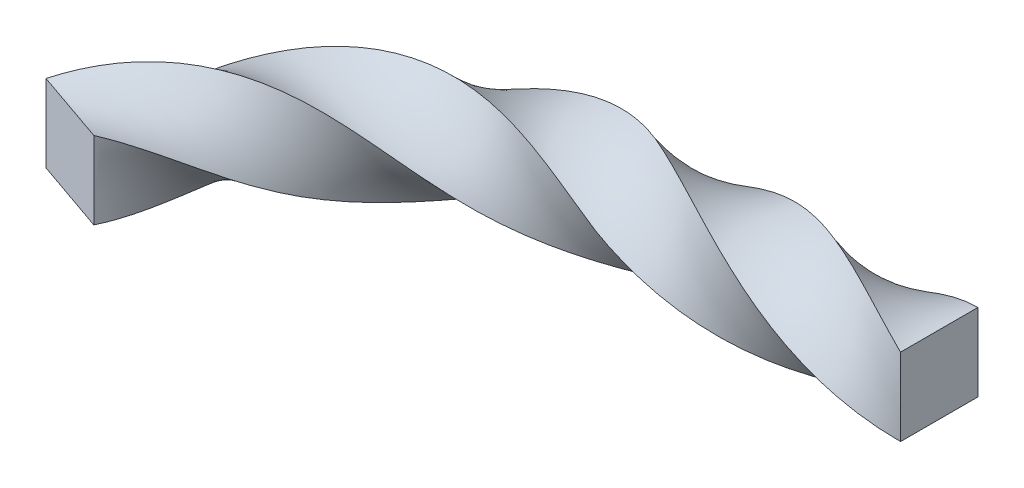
ISO-10303-21;
HEADER;
FILE_DESCRIPTION(('STEP AP214'),'2;1');
FILE_NAME('part.step','',(''),(''),'','','');
FILE_SCHEMA(('AUTOMOTIVE_DESIGN { 1 0 10303 214 1 1 1 1 }'));
ENDSEC;
DATA;
#1=APPLICATION_CONTEXT('core data for automotive mechanical design processes');
#2=APPLICATION_PROTOCOL_DEFINITION('international standard','automotive_design',2000,#1);
#3=PRODUCT_CONTEXT('',#1,'mechanical');
#4=PRODUCT('Part','Part','',(#3));
#5=PRODUCT_RELATED_PRODUCT_CATEGORY('part','',(#4));
#6=PRODUCT_DEFINITION_FORMATION('','',#4);
#7=PRODUCT_DEFINITION_CONTEXT('part definition',#1,'design');
#8=PRODUCT_DEFINITION('design','',#6,#7);
#9=PRODUCT_DEFINITION_SHAPE('','',#8);
#10=(LENGTH_UNIT() NAMED_UNIT(*) SI_UNIT(.MILLI.,.METRE.));
#11=(NAMED_UNIT(*) PLANE_ANGLE_UNIT() SI_UNIT($,.RADIAN.));
#12=(NAMED_UNIT(*) SI_UNIT($,.STERADIAN.) SOLID_ANGLE_UNIT());
#13=UNCERTAINTY_MEASURE_WITH_UNIT(LENGTH_MEASURE(1.E-05),#10,'distance_accuracy_value','');
#14=(GEOMETRIC_REPRESENTATION_CONTEXT(3) GLOBAL_UNCERTAINTY_ASSIGNED_CONTEXT((#13)) GLOBAL_UNIT_ASSIGNED_CONTEXT((#10,
#11,#12)) REPRESENTATION_CONTEXT('',''));
#15=CARTESIAN_POINT('',(0.,0.,0.));
#16=DIRECTION('',(0.,0.,1.));
#17=DIRECTION('',(1.,0.,0.));
#18=AXIS2_PLACEMENT_3D('',#15,#16,#17);
#19=CARTESIAN_POINT('',(0.,0.,0.));
#20=DIRECTION('',(1.,0.,0.));
#21=DIRECTION('',(0.,0.,-1.));
#22=AXIS2_PLACEMENT_3D('',#19,#20,#21);
#23=PLANE('',#22);
#24=DIRECTION('',(0.,1.,0.));
#25=VECTOR('',#24,1.);
#26=CARTESIAN_POINT('',(0.,-21.,-21.));
#27=LINE('',#26,#25);
#28=CARTESIAN_POINT('',(0.,-21.,-21.));
#29=VERTEX_POINT('',#28);
#30=CARTESIAN_POINT('',(0.,21.,-21.));
#31=VERTEX_POINT('',#30);
#32=EDGE_CURVE('E95',#29,#31,#27,.T.);
#33=ORIENTED_EDGE('',*,*,#32,.T.);
#34=DIRECTION('',(0.,0.,1.));
#35=VECTOR('',#34,1.);
#36=CARTESIAN_POINT('',(0.,21.,-21.));
#37=LINE('',#36,#35);
#38=CARTESIAN_POINT('',(0.,21.,21.));
#39=VERTEX_POINT('',#38);
#40=EDGE_CURVE('E88',#31,#39,#37,.T.);
#41=ORIENTED_EDGE('',*,*,#40,.T.);
#42=DIRECTION('',(0.,-1.,0.));
#43=VECTOR('',#42,1.);
#44=CARTESIAN_POINT('',(0.,-21.,21.));
#45=LINE('',#44,#43);
#46=CARTESIAN_POINT('',(0.,-21.,21.));
#47=VERTEX_POINT('',#46);
#48=EDGE_CURVE('E83',#39,#47,#45,.T.);
#49=ORIENTED_EDGE('',*,*,#48,.T.);
#50=DIRECTION('',(0.,0.,-1.));
#51=VECTOR('',#50,1.);
#52=CARTESIAN_POINT('',(0.,-21.,-21.));
#53=LINE('',#52,#51);
#54=EDGE_CURVE('E78',#47,#29,#53,.T.);
#55=ORIENTED_EDGE('',*,*,#54,.T.);
#56=EDGE_LOOP('',(#33,#41,#49,#55));
#57=FACE_BOUND('',#56,.T.);
#58=ADVANCED_FACE('F43',(#57),#23,.T.);
#59=CARTESIAN_POINT('',(-340.19826274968,0.,131.));
#60=DIRECTION('',(0.328205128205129,0.,-0.944606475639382));
#61=DIRECTION('',(-0.944606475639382,0.,-0.328205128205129));
#62=AXIS2_PLACEMENT_3D('',#59,#60,#61);
#63=PLANE('',#62);
#64=DIRECTION('',(0.,1.,0.));
#65=VECTOR('',#64,1.);
#66=CARTESIAN_POINT('',(-360.034998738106,-21.0000000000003,124.107692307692));
#67=LINE('',#66,#65);
#68=CARTESIAN_POINT('',(-360.034998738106,-21.0000000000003,124.107692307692));
#69=VERTEX_POINT('',#68);
#70=CARTESIAN_POINT('',(-360.034998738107,20.9999999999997,124.107692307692));
#71=VERTEX_POINT('',#70);
#72=EDGE_CURVE('E123',#69,#71,#67,.T.);
#73=ORIENTED_EDGE('',*,*,#72,.F.);
#74=DIRECTION('',(-0.944606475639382,0.,-0.328205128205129));
#75=VECTOR('',#74,1.);
#76=CARTESIAN_POINT('',(-360.034998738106,-21.0000000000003,124.107692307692));
#77=LINE('',#76,#75);
#78=CARTESIAN_POINT('',(-320.361526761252,-20.9999999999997,137.892307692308));
#79=VERTEX_POINT('',#78);
#80=EDGE_CURVE('E11',#79,#69,#77,.T.);
#81=ORIENTED_EDGE('',*,*,#80,.F.);
#82=DIRECTION('',(0.,-1.,0.));
#83=VECTOR('',#82,1.);
#84=CARTESIAN_POINT('',(-320.361526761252,-20.9999999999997,137.892307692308));
#85=LINE('',#84,#83);
#86=CARTESIAN_POINT('',(-320.361526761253,21.0000000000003,137.892307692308));
#87=VERTEX_POINT('',#86);
#88=EDGE_CURVE('E51',#87,#79,#85,.T.);
#89=ORIENTED_EDGE('',*,*,#88,.F.);
#90=DIRECTION('',(0.944606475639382,0.,0.328205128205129));
#91=VECTOR('',#90,1.);
#92=CARTESIAN_POINT('',(-360.034998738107,20.9999999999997,124.107692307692));
#93=LINE('',#92,#91);
#94=EDGE_CURVE('E66',#71,#87,#93,.T.);
#95=ORIENTED_EDGE('',*,*,#94,.F.);
#96=EDGE_LOOP('',(#73,#81,#89,#95));
#97=FACE_BOUND('',#96,.T.);
#98=ADVANCED_FACE('F144',(#97),#63,.F.);
#99=CARTESIAN_POINT('',(0.,-21.,-21.));
#100=CARTESIAN_POINT('',(-6.50008105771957,-23.1598402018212,-18.8401597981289));
#101=CARTESIAN_POINT('',(-12.9999999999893,-24.9834839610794,-16.3448804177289));
#102=CARTESIAN_POINT('',(-26.0000000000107,-27.7873711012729,-10.9174902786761));
#103=CARTESIAN_POINT('',(-32.4999999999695,-28.7671659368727,-7.9862225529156));
#104=CARTESIAN_POINT('',(-45.5000000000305,-29.7904949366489,-1.96366955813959));
#105=CARTESIAN_POINT('',(-51.9999999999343,-29.8338752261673,1.12671011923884));
#106=CARTESIAN_POINT('',(-65.0000000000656,-28.9799957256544,7.17561387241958));
#107=CARTESIAN_POINT('',(-71.500000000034,-28.0828643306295,10.133228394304));
#108=CARTESIAN_POINT('',(-84.499999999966,-25.4324226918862,15.6371820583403));
#109=CARTESIAN_POINT('',(-91.000000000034,-23.6795109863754,18.1826935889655));
#110=CARTESIAN_POINT('',(-103.999999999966,-19.4828334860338,22.621865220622));
#111=CARTESIAN_POINT('',(-110.500000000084,-17.0396987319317,24.5148578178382));
#112=CARTESIAN_POINT('',(-123.499999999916,-11.6931489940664,27.4699809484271));
#113=CARTESIAN_POINT('',(-130.000000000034,-8.79053795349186,28.5316671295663));
#114=CARTESIAN_POINT('',(-139.749999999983,-4.29694568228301,29.4256462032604));
#115=CARTESIAN_POINT('',(-143.000000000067,-2.77606418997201,29.6078682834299));
#116=CARTESIAN_POINT('',(-147.874999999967,-0.487266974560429,29.7043038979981));
#117=CARTESIAN_POINT('',(-149.500000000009,0.276905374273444,29.7070096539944));
#118=CARTESIAN_POINT('',(-151.937499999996,1.42161673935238,29.6668970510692));
#119=CARTESIAN_POINT('',(-152.750000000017,1.80292930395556,29.6461670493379));
#120=CARTESIAN_POINT('',(-153.968749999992,2.37408600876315,29.6040564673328));
#121=CARTESIAN_POINT('',(-154.375000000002,2.56433622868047,29.5881838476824));
#122=CARTESIAN_POINT('',(-154.984374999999,2.84945547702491,29.561625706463));
#123=CARTESIAN_POINT('',(-155.187500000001,2.94445254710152,29.5523148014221));
#124=CARTESIAN_POINT('',(-155.593749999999,3.13435249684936,29.5327774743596));
#125=CARTESIAN_POINT('',(-155.812245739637,3.2292553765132,29.5225508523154));
#126=CARTESIAN_POINT('',(-156.145086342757,3.39740276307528,29.503611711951));
#127=CARTESIAN_POINT('',(-156.266437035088,3.47066802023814,29.4952435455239));
#128=CARTESIAN_POINT('',(-156.53293661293,3.61713295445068,29.4782837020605));
#129=CARTESIAN_POINT('',(-156.66620778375,3.69033263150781,29.4696918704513));
#130=CARTESIAN_POINT('',(-157.066090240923,3.90982719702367,29.4435816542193));
#131=CARTESIAN_POINT('',(-157.332770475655,4.05601761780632,29.425728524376));
#132=CARTESIAN_POINT('',(-158.133125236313,4.4941223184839,29.3708391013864));
#133=CARTESIAN_POINT('',(-158.667113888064,4.78556999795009,29.3324723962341));
#134=CARTESIAN_POINT('',(-160.270640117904,5.65765841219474,29.2121360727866));
#135=CARTESIAN_POINT('',(-161.341739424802,6.23604371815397,29.1249242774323));
#136=CARTESIAN_POINT('',(-164.563668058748,7.95909790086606,28.8432233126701));
#137=CARTESIAN_POINT('',(-166.723161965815,9.09164639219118,28.6285768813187));
#138=CARTESIAN_POINT('',(-173.254345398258,12.4167369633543,27.9146561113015));
#139=CARTESIAN_POINT('',(-177.679591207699,14.5362492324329,27.3441176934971));
#140=CARTESIAN_POINT('',(-191.288856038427,20.4239369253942,25.4831169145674));
#141=CARTESIAN_POINT('',(-200.827318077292,23.7088599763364,24.03193348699));
#142=CARTESIAN_POINT('',(-221.070101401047,28.2759787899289,21.8220037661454));
#143=CARTESIAN_POINT('',(-231.776652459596,29.5542811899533,21.0794161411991));
#144=CARTESIAN_POINT('',(-253.891037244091,29.8192855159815,21.5851663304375));
#145=CARTESIAN_POINT('',(-265.290896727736,28.8057615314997,22.8483112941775));
#146=CARTESIAN_POINT('',(-287.675743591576,24.7095254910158,28.3300358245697));
#147=CARTESIAN_POINT('',(-298.645929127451,21.6303053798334,32.5566764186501));
#148=CARTESIAN_POINT('',(-318.745450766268,14.0867520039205,44.2247356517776));
#149=CARTESIAN_POINT('',(-327.85801087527,9.62884944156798,51.6639210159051));
#150=CARTESIAN_POINT('',(-342.988094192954,0.321042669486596,69.2014509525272));
#151=CARTESIAN_POINT('',(-348.993509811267,-4.52092685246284,79.2882952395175));
#152=CARTESIAN_POINT('',(-357.268810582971,-13.51629542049,100.945954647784));
#153=CARTESIAN_POINT('',(-359.535810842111,-17.6627626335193,112.502835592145));
#154=CARTESIAN_POINT('',(-360.034998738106,-21.0000000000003,124.107692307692));
#155=CARTESIAN_POINT('',(0.,21.,-21.));
#156=CARTESIAN_POINT('',(-6.50008105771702,18.8401597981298,-23.1598402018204));
#157=CARTESIAN_POINT('',(-12.9999999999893,16.3448804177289,-24.9834839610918));
#158=CARTESIAN_POINT('',(-26.0000000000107,10.9174902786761,-27.7873711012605));
#159=CARTESIAN_POINT('',(-32.4999999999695,7.98622255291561,-28.7671659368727));
#160=CARTESIAN_POINT('',(-45.5000000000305,1.9636695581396,-29.7904949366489));
#161=CARTESIAN_POINT('',(-51.9999999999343,-1.12671011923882,-29.8338752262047));
#162=CARTESIAN_POINT('',(-65.0000000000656,-7.17561387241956,-28.979995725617));
#163=CARTESIAN_POINT('',(-71.500000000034,-10.1332283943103,-28.0828643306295));
#164=CARTESIAN_POINT('',(-84.499999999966,-15.6371820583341,-25.4324226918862));
#165=CARTESIAN_POINT('',(-91.000000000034,-18.1826935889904,-23.6795109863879));
#166=CARTESIAN_POINT('',(-103.999999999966,-22.6218652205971,-19.4828334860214));
#167=CARTESIAN_POINT('',(-110.500000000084,-24.5148578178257,-17.0396987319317));
#168=CARTESIAN_POINT('',(-123.499999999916,-27.4699809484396,-11.6931489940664));
#169=CARTESIAN_POINT('',(-130.000000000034,-28.5316671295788,-8.79053795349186));
#170=CARTESIAN_POINT('',(-139.749999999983,-29.4256462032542,-4.29694568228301));
#171=CARTESIAN_POINT('',(-143.000000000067,-29.6078682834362,-2.77606418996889));
#172=CARTESIAN_POINT('',(-147.874999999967,-29.7043038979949,-0.487266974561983));
#173=CARTESIAN_POINT('',(-149.500000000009,-29.7070096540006,0.276905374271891));
#174=CARTESIAN_POINT('',(-151.937499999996,-29.666897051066,1.42161673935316));
#175=CARTESIAN_POINT('',(-152.750000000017,-29.6461670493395,1.80292930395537));
#176=CARTESIAN_POINT('',(-153.968749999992,-29.604056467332,2.37408600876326));
#177=CARTESIAN_POINT('',(-154.375000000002,-29.588183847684,2.56433622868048));
#178=CARTESIAN_POINT('',(-154.984374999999,-29.5616257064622,2.84945547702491));
#179=CARTESIAN_POINT('',(-155.187500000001,-29.5523148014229,2.94445254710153));
#180=CARTESIAN_POINT('',(-155.593749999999,-29.5327774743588,3.13435249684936));
#181=CARTESIAN_POINT('',(-155.798606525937,-29.5225510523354,3.2292551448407));
#182=CARTESIAN_POINT('',(-156.155625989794,-29.5036115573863,3.39740294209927));
#183=CARTESIAN_POINT('',(-156.30839941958,-29.4950827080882,3.47085431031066));
#184=CARTESIAN_POINT('',(-156.616266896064,-29.4774793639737,3.61806312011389));
#185=CARTESIAN_POINT('',(-156.770023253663,-29.4684048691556,3.69182038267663));
#186=CARTESIAN_POINT('',(-157.230759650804,-29.4403636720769,3.91354272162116));
#187=CARTESIAN_POINT('',(-157.53720699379,-29.420579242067,4.0619583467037));
#188=CARTESIAN_POINT('',(-158.454414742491,-29.3579616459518,4.50894333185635));
#189=CARTESIAN_POINT('',(-159.063040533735,-29.3118639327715,4.80925074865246));
#190=CARTESIAN_POINT('',(-160.880363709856,-29.1605742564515,5.71661426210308));
#191=CARTESIAN_POINT('',(-162.080501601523,-29.0423819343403,6.33011039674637));
#192=CARTESIAN_POINT('',(-165.646745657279,-28.6364369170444,8.1923086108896));
#193=CARTESIAN_POINT('',(-167.97860008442,-28.2972564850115,9.46268915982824));
#194=CARTESIAN_POINT('',(-174.84075290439,-27.0812791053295,13.3290543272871));
#195=CARTESIAN_POINT('',(-179.236475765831,-26.0051628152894,15.9794069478));
#196=CARTESIAN_POINT('',(-191.959616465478,-22.071405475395,23.9202741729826));
#197=CARTESIAN_POINT('',(-199.812704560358,-18.4979484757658,29.1780849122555));
#198=CARTESIAN_POINT('',(-215.01146234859,-10.2348992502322,38.825890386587));
#199=CARTESIAN_POINT('',(-222.372176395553,-5.55235108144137,43.2121516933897));
#200=CARTESIAN_POINT('',(-237.488446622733,3.88514485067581,51.0665698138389));
#201=CARTESIAN_POINT('',(-245.257479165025,8.6320473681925,54.5409370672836));
#202=CARTESIAN_POINT('',(-261.757819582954,17.1383630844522,61.2492977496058));
#203=CARTESIAN_POINT('',(-270.495983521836,20.8905248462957,64.4971182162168));
#204=CARTESIAN_POINT('',(-288.830339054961,26.5677917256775,71.8375637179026));
#205=CARTESIAN_POINT('',(-298.423266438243,28.4880571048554,75.9457724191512));
#206=CARTESIAN_POINT('',(-317.616799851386,30.0696037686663,86.0241361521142));
#207=CARTESIAN_POINT('',(-327.205199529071,29.7295368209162,92.0055986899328));
#208=CARTESIAN_POINT('',(-345.019992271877,26.8624998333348,106.337974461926));
#209=CARTESIAN_POINT('',(-353.224341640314,24.3405320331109,114.68413825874));
#210=CARTESIAN_POINT('',(-360.034998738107,20.9999999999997,124.107692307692));
#211=B_SPLINE_SURFACE_WITH_KNOTS('',1,3,((#99,#100,#101,#102,#103,#104,#105,#106,#107,#108,#109,
#110,#111,#112,#113,#114,#115,#116,#117,#118,#119,#120,#121,#122,#123,#124,#125,#126,#127,#128,
#129,#130,#131,#132,#133,#134,#135,#136,#137,#138,#139,#140,#141,#142,#143,#144,#145,#146,#147,
#148,#149,#150,#151,#152,#153,#154),(#155,#156,#157,#158,#159,#160,#161,#162,#163,#164,#165,
#166,#167,#168,#169,#170,#171,#172,#173,#174,#175,#176,#177,#178,#179,#180,#181,#182,#183,#184,
#185,#186,#187,#188,#189,#190,#191,#192,#193,#194,#195,#196,#197,#198,#199,#200,#201,#202,#203,
#204,#205,#206,#207,#208,#209,#210)),.UNSPECIFIED.,.F.,.F.,.F.,(2,2),(4,2,2,2,2,2,2,2,2,2,2,2,2,
2,2,2,2,2,2,2,2,2,2,2,2,2,2,4),(0.,1.),(0.,0.0491064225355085,0.0982128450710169,
0.147319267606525,0.196425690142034,0.245532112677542,0.294638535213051,0.343744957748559,
0.368298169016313,0.380574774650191,0.386713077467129,0.389782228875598,0.391316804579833,
0.392851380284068,0.39403721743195,0.395223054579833,0.397594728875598,0.402338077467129,
0.411824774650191,0.430798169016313,0.468744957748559,0.544638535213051,0.620532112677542,
0.696425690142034,0.772319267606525,0.848212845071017,0.924106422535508,1.),.UNSPECIFIED.);
#212=CARTESIAN_POINT('',(0.,21.,-21.));
#213=CARTESIAN_POINT('',(-6.50008105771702,18.8401597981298,-23.1598402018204));
#214=CARTESIAN_POINT('',(-12.9999999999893,16.3448804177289,-24.9834839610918));
#215=CARTESIAN_POINT('',(-26.0000000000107,10.9174902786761,-27.7873711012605));
#216=CARTESIAN_POINT('',(-32.4999999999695,7.98622255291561,-28.7671659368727));
#217=CARTESIAN_POINT('',(-45.5000000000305,1.9636695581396,-29.7904949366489));
#218=CARTESIAN_POINT('',(-51.9999999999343,-1.12671011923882,-29.8338752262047));
#219=CARTESIAN_POINT('',(-65.0000000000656,-7.17561387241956,-28.979995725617));
#220=CARTESIAN_POINT('',(-71.500000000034,-10.1332283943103,-28.0828643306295));
#221=CARTESIAN_POINT('',(-84.499999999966,-15.6371820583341,-25.4324226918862));
#222=CARTESIAN_POINT('',(-91.000000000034,-18.1826935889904,-23.6795109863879));
#223=CARTESIAN_POINT('',(-103.999999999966,-22.6218652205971,-19.4828334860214));
#224=CARTESIAN_POINT('',(-110.500000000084,-24.5148578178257,-17.0396987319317));
#225=CARTESIAN_POINT('',(-123.499999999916,-27.4699809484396,-11.6931489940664));
#226=CARTESIAN_POINT('',(-130.000000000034,-28.5316671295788,-8.79053795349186));
#227=CARTESIAN_POINT('',(-139.749999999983,-29.4256462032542,-4.29694568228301));
#228=CARTESIAN_POINT('',(-143.000000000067,-29.6078682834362,-2.77606418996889));
#229=CARTESIAN_POINT('',(-147.874999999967,-29.7043038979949,-0.487266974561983));
#230=CARTESIAN_POINT('',(-149.500000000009,-29.7070096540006,0.276905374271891));
#231=CARTESIAN_POINT('',(-151.937499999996,-29.666897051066,1.42161673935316));
#232=CARTESIAN_POINT('',(-152.750000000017,-29.6461670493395,1.80292930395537));
#233=CARTESIAN_POINT('',(-153.968749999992,-29.604056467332,2.37408600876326));
#234=CARTESIAN_POINT('',(-154.375000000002,-29.588183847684,2.56433622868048));
#235=CARTESIAN_POINT('',(-154.984374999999,-29.5616257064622,2.84945547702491));
#236=CARTESIAN_POINT('',(-155.187500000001,-29.5523148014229,2.94445254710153));
#237=CARTESIAN_POINT('',(-155.593749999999,-29.5327774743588,3.13435249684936));
#238=CARTESIAN_POINT('',(-155.798606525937,-29.5225510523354,3.2292551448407));
#239=CARTESIAN_POINT('',(-156.155625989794,-29.5036115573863,3.39740294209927));
#240=CARTESIAN_POINT('',(-156.30839941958,-29.4950827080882,3.47085431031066));
#241=CARTESIAN_POINT('',(-156.616266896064,-29.4774793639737,3.61806312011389));
#242=CARTESIAN_POINT('',(-156.770023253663,-29.4684048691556,3.69182038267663));
#243=CARTESIAN_POINT('',(-157.230759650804,-29.4403636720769,3.91354272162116));
#244=CARTESIAN_POINT('',(-157.53720699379,-29.420579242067,4.0619583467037));
#245=CARTESIAN_POINT('',(-158.454414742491,-29.3579616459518,4.50894333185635));
#246=CARTESIAN_POINT('',(-159.063040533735,-29.3118639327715,4.80925074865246));
#247=CARTESIAN_POINT('',(-160.880363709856,-29.1605742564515,5.71661426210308));
#248=CARTESIAN_POINT('',(-162.080501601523,-29.0423819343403,6.33011039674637));
#249=CARTESIAN_POINT('',(-165.646745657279,-28.6364369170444,8.1923086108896));
#250=CARTESIAN_POINT('',(-167.97860008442,-28.2972564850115,9.46268915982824));
#251=CARTESIAN_POINT('',(-174.84075290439,-27.0812791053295,13.3290543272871));
#252=CARTESIAN_POINT('',(-179.236475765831,-26.0051628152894,15.9794069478));
#253=CARTESIAN_POINT('',(-191.959616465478,-22.071405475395,23.9202741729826));
#254=CARTESIAN_POINT('',(-199.812704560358,-18.4979484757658,29.1780849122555));
#255=CARTESIAN_POINT('',(-215.01146234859,-10.2348992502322,38.825890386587));
#256=CARTESIAN_POINT('',(-222.372176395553,-5.55235108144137,43.2121516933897));
#257=CARTESIAN_POINT('',(-237.488446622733,3.88514485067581,51.0665698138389));
#258=CARTESIAN_POINT('',(-245.257479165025,8.6320473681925,54.5409370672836));
#259=CARTESIAN_POINT('',(-261.757819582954,17.1383630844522,61.2492977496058));
#260=CARTESIAN_POINT('',(-270.495983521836,20.8905248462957,64.4971182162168));
#261=CARTESIAN_POINT('',(-288.830339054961,26.5677917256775,71.8375637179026));
#262=CARTESIAN_POINT('',(-298.423266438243,28.4880571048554,75.9457724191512));
#263=CARTESIAN_POINT('',(-317.616799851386,30.0696037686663,86.0241361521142));
#264=CARTESIAN_POINT('',(-327.205199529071,29.7295368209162,92.0055986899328));
#265=CARTESIAN_POINT('',(-345.019992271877,26.8624998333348,106.337974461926));
#266=CARTESIAN_POINT('',(-353.224341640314,24.3405320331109,114.68413825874));
#267=CARTESIAN_POINT('',(-360.034998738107,20.9999999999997,124.107692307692));
#268=B_SPLINE_CURVE_WITH_KNOTS('',3,(#212,#213,#214,#215,#216,#217,#218,#219,#220,#221,#222,
#223,#224,#225,#226,#227,#228,#229,#230,#231,#232,#233,#234,#235,#236,#237,#238,#239,#240,#241,
#242,#243,#244,#245,#246,#247,#248,#249,#250,#251,#252,#253,#254,#255,#256,#257,#258,#259,#260,
#261,#262,#263,#264,#265,#266,#267),.UNSPECIFIED.,.F.,.F.,(4,2,2,2,2,2,2,2,2,2,2,2,2,2,2,2,2,2,
2,2,2,2,2,2,2,2,2,4),(0.,0.0491064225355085,0.0982128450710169,0.147319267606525,
0.196425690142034,0.245532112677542,0.294638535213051,0.343744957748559,0.368298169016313,
0.380574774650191,0.386713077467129,0.389782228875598,0.391316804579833,0.392851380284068,
0.39403721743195,0.395223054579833,0.397594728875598,0.402338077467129,0.411824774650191,
0.430798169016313,0.468744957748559,0.544638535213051,0.620532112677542,0.696425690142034,
0.772319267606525,0.848212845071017,0.924106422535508,1.),.UNSPECIFIED.);
#269=EDGE_CURVE('E98',#31,#71,#268,.T.);
#270=CARTESIAN_POINT('',(0.,-21.,-21.));
#271=CARTESIAN_POINT('',(-6.50008105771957,-23.1598402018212,-18.8401597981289));
#272=CARTESIAN_POINT('',(-12.9999999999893,-24.9834839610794,-16.3448804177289));
#273=CARTESIAN_POINT('',(-26.0000000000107,-27.7873711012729,-10.9174902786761));
#274=CARTESIAN_POINT('',(-32.4999999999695,-28.7671659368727,-7.9862225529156));
#275=CARTESIAN_POINT('',(-45.5000000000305,-29.7904949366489,-1.96366955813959));
#276=CARTESIAN_POINT('',(-51.9999999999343,-29.8338752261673,1.12671011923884));
#277=CARTESIAN_POINT('',(-65.0000000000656,-28.9799957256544,7.17561387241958));
#278=CARTESIAN_POINT('',(-71.500000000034,-28.0828643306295,10.133228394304));
#279=CARTESIAN_POINT('',(-84.499999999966,-25.4324226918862,15.6371820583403));
#280=CARTESIAN_POINT('',(-91.000000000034,-23.6795109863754,18.1826935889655));
#281=CARTESIAN_POINT('',(-103.999999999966,-19.4828334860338,22.621865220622));
#282=CARTESIAN_POINT('',(-110.500000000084,-17.0396987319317,24.5148578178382));
#283=CARTESIAN_POINT('',(-123.499999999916,-11.6931489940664,27.4699809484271));
#284=CARTESIAN_POINT('',(-130.000000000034,-8.79053795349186,28.5316671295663));
#285=CARTESIAN_POINT('',(-139.749999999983,-4.29694568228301,29.4256462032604));
#286=CARTESIAN_POINT('',(-143.000000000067,-2.77606418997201,29.6078682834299));
#287=CARTESIAN_POINT('',(-147.874999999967,-0.487266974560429,29.7043038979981));
#288=CARTESIAN_POINT('',(-149.500000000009,0.276905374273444,29.7070096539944));
#289=CARTESIAN_POINT('',(-151.937499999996,1.42161673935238,29.6668970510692));
#290=CARTESIAN_POINT('',(-152.750000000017,1.80292930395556,29.6461670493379));
#291=CARTESIAN_POINT('',(-153.968749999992,2.37408600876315,29.6040564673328));
#292=CARTESIAN_POINT('',(-154.375000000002,2.56433622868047,29.5881838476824));
#293=CARTESIAN_POINT('',(-154.984374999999,2.84945547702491,29.561625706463));
#294=CARTESIAN_POINT('',(-155.187500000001,2.94445254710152,29.5523148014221));
#295=CARTESIAN_POINT('',(-155.593749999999,3.13435249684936,29.5327774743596));
#296=CARTESIAN_POINT('',(-155.812245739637,3.2292553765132,29.5225508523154));
#297=CARTESIAN_POINT('',(-156.145086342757,3.39740276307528,29.503611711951));
#298=CARTESIAN_POINT('',(-156.266437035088,3.47066802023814,29.4952435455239));
#299=CARTESIAN_POINT('',(-156.53293661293,3.61713295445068,29.4782837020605));
#300=CARTESIAN_POINT('',(-156.66620778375,3.69033263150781,29.4696918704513));
#301=CARTESIAN_POINT('',(-157.066090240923,3.90982719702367,29.4435816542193));
#302=CARTESIAN_POINT('',(-157.332770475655,4.05601761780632,29.425728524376));
#303=CARTESIAN_POINT('',(-158.133125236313,4.4941223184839,29.3708391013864));
#304=CARTESIAN_POINT('',(-158.667113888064,4.78556999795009,29.3324723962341));
#305=CARTESIAN_POINT('',(-160.270640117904,5.65765841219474,29.2121360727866));
#306=CARTESIAN_POINT('',(-161.341739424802,6.23604371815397,29.1249242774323));
#307=CARTESIAN_POINT('',(-164.563668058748,7.95909790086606,28.8432233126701));
#308=CARTESIAN_POINT('',(-166.723161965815,9.09164639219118,28.6285768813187));
#309=CARTESIAN_POINT('',(-173.254345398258,12.4167369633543,27.9146561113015));
#310=CARTESIAN_POINT('',(-177.679591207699,14.5362492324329,27.3441176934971));
#311=CARTESIAN_POINT('',(-191.288856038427,20.4239369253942,25.4831169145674));
#312=CARTESIAN_POINT('',(-200.827318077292,23.7088599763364,24.03193348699));
#313=CARTESIAN_POINT('',(-221.070101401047,28.2759787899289,21.8220037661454));
#314=CARTESIAN_POINT('',(-231.776652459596,29.5542811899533,21.0794161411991));
#315=CARTESIAN_POINT('',(-253.891037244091,29.8192855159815,21.5851663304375));
#316=CARTESIAN_POINT('',(-265.290896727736,28.8057615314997,22.8483112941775));
#317=CARTESIAN_POINT('',(-287.675743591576,24.7095254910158,28.3300358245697));
#318=CARTESIAN_POINT('',(-298.645929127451,21.6303053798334,32.5566764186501));
#319=CARTESIAN_POINT('',(-318.745450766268,14.0867520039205,44.2247356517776));
#320=CARTESIAN_POINT('',(-327.85801087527,9.62884944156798,51.6639210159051));
#321=CARTESIAN_POINT('',(-342.988094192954,0.321042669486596,69.2014509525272));
#322=CARTESIAN_POINT('',(-348.993509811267,-4.52092685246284,79.2882952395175));
#323=CARTESIAN_POINT('',(-357.268810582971,-13.51629542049,100.945954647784));
#324=CARTESIAN_POINT('',(-359.535810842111,-17.6627626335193,112.502835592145));
#325=CARTESIAN_POINT('',(-360.034998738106,-21.0000000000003,124.107692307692));
#326=B_SPLINE_CURVE_WITH_KNOTS('',3,(#270,#271,#272,#273,#274,#275,#276,#277,#278,#279,#280,
#281,#282,#283,#284,#285,#286,#287,#288,#289,#290,#291,#292,#293,#294,#295,#296,#297,#298,#299,
#300,#301,#302,#303,#304,#305,#306,#307,#308,#309,#310,#311,#312,#313,#314,#315,#316,#317,#318,
#319,#320,#321,#322,#323,#324,#325),.UNSPECIFIED.,.F.,.F.,(4,2,2,2,2,2,2,2,2,2,2,2,2,2,2,2,2,2,
2,2,2,2,2,2,2,2,2,4),(0.,0.0491064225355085,0.0982128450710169,0.147319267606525,
0.196425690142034,0.245532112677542,0.294638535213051,0.343744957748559,0.368298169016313,
0.380574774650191,0.386713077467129,0.389782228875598,0.391316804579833,0.392851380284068,
0.39403721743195,0.395223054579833,0.397594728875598,0.402338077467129,0.411824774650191,
0.430798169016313,0.468744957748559,0.544638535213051,0.620532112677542,0.696425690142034,
0.772319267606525,0.848212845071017,0.924106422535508,1.),.UNSPECIFIED.);
#327=EDGE_CURVE('E97',#29,#69,#326,.T.);
#328=ORIENTED_EDGE('',*,*,#269,.F.);
#329=ORIENTED_EDGE('',*,*,#32,.F.);
#330=ORIENTED_EDGE('',*,*,#327,.T.);
#331=ORIENTED_EDGE('',*,*,#72,.T.);
#332=EDGE_LOOP('',(#328,#329,#330,#331));
#333=FACE_BOUND('',#332,.T.);
#334=ADVANCED_FACE('F96',(#333),#211,.F.);
#335=CARTESIAN_POINT('',(0.,21.,-21.));
#336=CARTESIAN_POINT('',(-6.50008105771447,18.8401597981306,-23.1598402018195));
#337=CARTESIAN_POINT('',(-12.9999999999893,16.3448804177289,-24.9834839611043));
#338=CARTESIAN_POINT('',(-26.0000000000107,10.9174902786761,-27.787371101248));
#339=CARTESIAN_POINT('',(-32.4999999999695,7.98622255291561,-28.7671659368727));
#340=CARTESIAN_POINT('',(-45.5000000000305,1.9636695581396,-29.7904949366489));
#341=CARTESIAN_POINT('',(-51.9999999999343,-1.12671011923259,-29.8338752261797));
#342=CARTESIAN_POINT('',(-65.0000000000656,-7.17561387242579,-28.9799957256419));
#343=CARTESIAN_POINT('',(-71.500000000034,-10.133228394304,-28.0828643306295));
#344=CARTESIAN_POINT('',(-84.499999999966,-15.6371820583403,-25.4324226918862));
#345=CARTESIAN_POINT('',(-91.000000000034,-18.1826935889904,-23.6795109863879));
#346=CARTESIAN_POINT('',(-103.999999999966,-22.6218652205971,-19.4828334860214));
#347=CARTESIAN_POINT('',(-110.500000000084,-24.5148578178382,-17.0396987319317));
#348=CARTESIAN_POINT('',(-123.499999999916,-27.4699809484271,-11.6931489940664));
#349=CARTESIAN_POINT('',(-130.000000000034,-28.5316671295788,-8.79053795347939));
#350=CARTESIAN_POINT('',(-139.749999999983,-29.4256462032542,-4.29694568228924));
#351=CARTESIAN_POINT('',(-143.000000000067,-29.6078682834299,-2.77606418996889));
#352=CARTESIAN_POINT('',(-147.874999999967,-29.7043038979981,-0.48726697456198));
#353=CARTESIAN_POINT('',(-149.500000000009,-29.7070096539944,0.27690537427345));
#354=CARTESIAN_POINT('',(-151.937499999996,-29.6668970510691,1.42161673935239));
#355=CARTESIAN_POINT('',(-152.750000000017,-29.6461670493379,1.80292930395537));
#356=CARTESIAN_POINT('',(-153.968749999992,-29.6040564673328,2.37408600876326));
#357=CARTESIAN_POINT('',(-154.375000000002,-29.5881838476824,2.56433622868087));
#358=CARTESIAN_POINT('',(-154.984374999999,-29.561625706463,2.84945547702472));
#359=CARTESIAN_POINT('',(-155.187500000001,-29.5523148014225,2.94445254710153));
#360=CARTESIAN_POINT('',(-155.593749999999,-29.5327774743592,3.13435249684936));
#361=CARTESIAN_POINT('',(-155.798606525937,-29.5225510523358,3.22925514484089));
#362=CARTESIAN_POINT('',(-156.155625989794,-29.503611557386,3.39740294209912));
#363=CARTESIAN_POINT('',(-156.30839941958,-29.4950827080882,3.47085431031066));
#364=CARTESIAN_POINT('',(-156.616266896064,-29.4774793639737,3.61806312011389));
#365=CARTESIAN_POINT('',(-156.770023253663,-29.4684048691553,3.69182038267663));
#366=CARTESIAN_POINT('',(-157.230759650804,-29.4403636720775,3.91354272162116));
#367=CARTESIAN_POINT('',(-157.53720699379,-29.420579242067,4.06195834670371));
#368=CARTESIAN_POINT('',(-158.454414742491,-29.3579616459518,4.50894333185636));
#369=CARTESIAN_POINT('',(-159.063040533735,-29.3118639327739,4.80925074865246));
#370=CARTESIAN_POINT('',(-160.880363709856,-29.1605742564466,5.71661426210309));
#371=CARTESIAN_POINT('',(-162.080501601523,-29.0423819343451,6.33011039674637));
#372=CARTESIAN_POINT('',(-165.646745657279,-28.6364369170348,8.19230861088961));
#373=CARTESIAN_POINT('',(-167.97860008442,-28.2972564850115,9.46268915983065));
#374=CARTESIAN_POINT('',(-174.84075290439,-27.0812791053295,13.3290543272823));
#375=CARTESIAN_POINT('',(-179.236475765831,-26.0051628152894,15.9794069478));
#376=CARTESIAN_POINT('',(-191.959616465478,-22.071405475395,23.9202741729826));
#377=CARTESIAN_POINT('',(-199.812704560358,-18.4979484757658,29.178084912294));
#378=CARTESIAN_POINT('',(-215.01146234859,-10.2348992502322,38.8258903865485));
#379=CARTESIAN_POINT('',(-222.372176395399,-5.55235108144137,43.2121516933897));
#380=CARTESIAN_POINT('',(-237.488446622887,3.88514485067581,51.0665698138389));
#381=CARTESIAN_POINT('',(-245.257479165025,8.6320473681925,54.5409370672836));
#382=CARTESIAN_POINT('',(-261.757819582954,17.1383630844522,61.2492977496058));
#383=CARTESIAN_POINT('',(-270.495983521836,20.8905248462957,64.4971182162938));
#384=CARTESIAN_POINT('',(-288.830339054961,26.5677917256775,71.8375637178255));
#385=CARTESIAN_POINT('',(-298.423266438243,28.4880571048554,75.9457724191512));
#386=CARTESIAN_POINT('',(-317.616799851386,30.0696037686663,86.0241361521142));
#387=CARTESIAN_POINT('',(-327.205199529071,29.7295368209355,92.0055986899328));
#388=CARTESIAN_POINT('',(-345.019992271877,26.8624998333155,106.337974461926));
#389=CARTESIAN_POINT('',(-353.224341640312,24.340532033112,114.684138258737));
#390=CARTESIAN_POINT('',(-360.034998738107,20.9999999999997,124.107692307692));
#391=CARTESIAN_POINT('',(0.,21.,21.));
#392=CARTESIAN_POINT('',(-6.5000810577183,23.1598402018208,18.8401597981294));
#393=CARTESIAN_POINT('',(-12.9999999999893,24.9834839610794,16.3448804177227));
#394=CARTESIAN_POINT('',(-26.0000000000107,27.7873711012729,10.9174902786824));
#395=CARTESIAN_POINT('',(-32.4999999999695,28.7671659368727,7.98622255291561));
#396=CARTESIAN_POINT('',(-45.5000000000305,29.7904949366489,1.9636695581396));
#397=CARTESIAN_POINT('',(-51.9999999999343,29.8338752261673,-1.12671011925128));
#398=CARTESIAN_POINT('',(-65.0000000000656,28.9799957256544,-7.17561387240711));
#399=CARTESIAN_POINT('',(-71.500000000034,28.0828643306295,-10.1332283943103));
#400=CARTESIAN_POINT('',(-84.499999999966,25.4324226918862,-15.6371820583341));
#401=CARTESIAN_POINT('',(-91.000000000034,23.6795109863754,-18.1826935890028));
#402=CARTESIAN_POINT('',(-103.999999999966,19.4828334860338,-22.6218652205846));
#403=CARTESIAN_POINT('',(-110.500000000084,17.0396987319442,-24.5148578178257));
#404=CARTESIAN_POINT('',(-123.499999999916,11.693148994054,-27.4699809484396));
#405=CARTESIAN_POINT('',(-130.000000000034,8.79053795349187,-28.5316671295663));
#406=CARTESIAN_POINT('',(-139.749999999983,4.29694568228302,-29.4256462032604));
#407=CARTESIAN_POINT('',(-143.000000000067,2.77606418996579,-29.6078682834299));
#408=CARTESIAN_POINT('',(-147.874999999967,0.487266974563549,-29.7043038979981));
#409=CARTESIAN_POINT('',(-149.500000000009,-0.27690537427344,-29.7070096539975));
#410=CARTESIAN_POINT('',(-151.937499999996,-1.42161673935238,-29.6668970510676));
#411=CARTESIAN_POINT('',(-152.750000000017,-1.80292930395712,-29.6461670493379));
#412=CARTESIAN_POINT('',(-153.968749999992,-2.37408600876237,-29.6040564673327));
#413=CARTESIAN_POINT('',(-154.375000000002,-2.56433622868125,-29.5881838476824));
#414=CARTESIAN_POINT('',(-154.984374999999,-2.84945547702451,-29.5616257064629));
#415=CARTESIAN_POINT('',(-155.187500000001,-2.94445254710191,-29.5523148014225));
#416=CARTESIAN_POINT('',(-155.593749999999,-3.13435249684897,-29.5327774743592));
#417=CARTESIAN_POINT('',(-155.781504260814,-3.22925537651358,-29.5225513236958));
#418=CARTESIAN_POINT('',(-156.168841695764,-3.39740276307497,-29.5036113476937));
#419=CARTESIAN_POINT('',(-156.361418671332,-3.47066802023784,-29.4948645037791));
#420=CARTESIAN_POINT('',(-156.722771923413,-3.61713295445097,-29.4763885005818));
#421=CARTESIAN_POINT('',(-156.903425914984,-3.69033263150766,-29.4666595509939));
#422=CARTESIAN_POINT('',(-157.445312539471,-3.90982719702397,-29.4360008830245));
#423=CARTESIAN_POINT('',(-157.806469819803,-4.05601761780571,-29.4135993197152));
#424=CARTESIAN_POINT('',(-158.889580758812,-4.4941223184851,-29.3405164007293));
#425=CARTESIAN_POINT('',(-159.611173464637,-4.78556999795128,-29.2839564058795));
#426=CARTESIAN_POINT('',(-161.774033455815,-5.65765841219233,-29.0908500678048));
#427=CARTESIAN_POINT('',(-163.213381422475,-6.23604371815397,-28.9308708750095));
#428=CARTESIAN_POINT('',(-167.519989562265,-7.95909790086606,-28.3581459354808));
#429=CARTESIAN_POINT('',(-170.375782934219,-9.09164639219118,-27.8525121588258));
#430=CARTESIAN_POINT('',(-178.868125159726,-12.4167369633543,-25.9753506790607));
#431=CARTESIAN_POINT('',(-184.428781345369,-14.5362492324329,-24.2421286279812));
#432=CARTESIAN_POINT('',(-200.597970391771,-20.4239369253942,-17.7418963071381));
#433=CARTESIAN_POINT('',(-210.671402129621,-23.7088599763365,-11.6609429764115));
#434=CARTESIAN_POINT('',(-228.707074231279,-28.275978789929,2.77258575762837));
#435=CARTESIAN_POINT('',(-236.666003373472,-29.5542811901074,11.1086571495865));
#436=CARTESIAN_POINT('',(-250.492880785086,-29.8192855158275,28.5735360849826));
#437=CARTESIAN_POINT('',(-256.367097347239,-28.8057615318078,37.6866835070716));
#438=CARTESIAN_POINT('',(-266.728204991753,-24.7095254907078,55.4935610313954));
#439=CARTESIAN_POINT('',(-271.228972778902,-21.6303053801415,64.1785721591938));
#440=CARTESIAN_POINT('',(-279.900730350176,-14.0867520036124,80.5628093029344));
#441=CARTESIAN_POINT('',(-284.087130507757,-9.62884944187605,88.2629371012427));
#442=CARTESIAN_POINT('',(-293.066723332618,-0.321042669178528,102.871636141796));
#443=CARTESIAN_POINT('',(-297.870975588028,4.52092685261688,109.790223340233));
#444=CARTESIAN_POINT('',(-308.46968989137,13.516295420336,123.606958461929));
#445=CARTESIAN_POINT('',(-314.262263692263,17.6598330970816,130.515102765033));
#446=CARTESIAN_POINT('',(-320.361526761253,21.0000000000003,137.892307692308));
#447=B_SPLINE_SURFACE_WITH_KNOTS('',1,3,((#335,#336,#337,#338,#339,#340,#341,#342,#343,#344,
#345,#346,#347,#348,#349,#350,#351,#352,#353,#354,#355,#356,#357,#358,#359,#360,#361,#362,#363,
#364,#365,#366,#367,#368,#369,#370,#371,#372,#373,#374,#375,#376,#377,#378,#379,#380,#381,#382,
#383,#384,#385,#386,#387,#388,#389,#390),(#391,#392,#393,#394,#395,#396,#397,#398,#399,#400,
#401,#402,#403,#404,#405,#406,#407,#408,#409,#410,#411,#412,#413,#414,#415,#416,#417,#418,#419,
#420,#421,#422,#423,#424,#425,#426,#427,#428,#429,#430,#431,#432,#433,#434,#435,#436,#437,#438,
#439,#440,#441,#442,#443,#444,#445,#446)),.UNSPECIFIED.,.F.,.F.,.F.,(2,2),(4,2,2,2,2,2,2,2,2,2,
2,2,2,2,2,2,2,2,2,2,2,2,2,2,2,2,2,4),(0.,1.),(0.,0.0491064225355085,0.0982128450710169,
0.147319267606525,0.196425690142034,0.245532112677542,0.294638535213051,0.343744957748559,
0.368298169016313,0.380574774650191,0.386713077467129,0.389782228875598,0.391316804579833,
0.392851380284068,0.39403721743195,0.395223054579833,0.397594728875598,0.402338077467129,
0.411824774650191,0.430798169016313,0.468744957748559,0.544638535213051,0.620532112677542,
0.696425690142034,0.772319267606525,0.848212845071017,0.924106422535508,1.),.UNSPECIFIED.);
#448=CARTESIAN_POINT('',(0.,21.,21.));
#449=CARTESIAN_POINT('',(-6.5000810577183,23.1598402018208,18.8401597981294));
#450=CARTESIAN_POINT('',(-12.9999999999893,24.9834839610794,16.3448804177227));
#451=CARTESIAN_POINT('',(-26.0000000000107,27.7873711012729,10.9174902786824));
#452=CARTESIAN_POINT('',(-32.4999999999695,28.7671659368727,7.98622255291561));
#453=CARTESIAN_POINT('',(-45.5000000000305,29.7904949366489,1.9636695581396));
#454=CARTESIAN_POINT('',(-51.9999999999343,29.8338752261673,-1.12671011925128));
#455=CARTESIAN_POINT('',(-65.0000000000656,28.9799957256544,-7.17561387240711));
#456=CARTESIAN_POINT('',(-71.500000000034,28.0828643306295,-10.1332283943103));
#457=CARTESIAN_POINT('',(-84.499999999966,25.4324226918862,-15.6371820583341));
#458=CARTESIAN_POINT('',(-91.000000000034,23.6795109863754,-18.1826935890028));
#459=CARTESIAN_POINT('',(-103.999999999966,19.4828334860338,-22.6218652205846));
#460=CARTESIAN_POINT('',(-110.500000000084,17.0396987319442,-24.5148578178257));
#461=CARTESIAN_POINT('',(-123.499999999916,11.693148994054,-27.4699809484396));
#462=CARTESIAN_POINT('',(-130.000000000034,8.79053795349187,-28.5316671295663));
#463=CARTESIAN_POINT('',(-139.749999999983,4.29694568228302,-29.4256462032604));
#464=CARTESIAN_POINT('',(-143.000000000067,2.77606418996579,-29.6078682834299));
#465=CARTESIAN_POINT('',(-147.874999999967,0.487266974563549,-29.7043038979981));
#466=CARTESIAN_POINT('',(-149.500000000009,-0.27690537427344,-29.7070096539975));
#467=CARTESIAN_POINT('',(-151.937499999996,-1.42161673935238,-29.6668970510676));
#468=CARTESIAN_POINT('',(-152.750000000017,-1.80292930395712,-29.6461670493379));
#469=CARTESIAN_POINT('',(-153.968749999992,-2.37408600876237,-29.6040564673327));
#470=CARTESIAN_POINT('',(-154.375000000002,-2.56433622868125,-29.5881838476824));
#471=CARTESIAN_POINT('',(-154.984374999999,-2.84945547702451,-29.5616257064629));
#472=CARTESIAN_POINT('',(-155.187500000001,-2.94445254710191,-29.5523148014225));
#473=CARTESIAN_POINT('',(-155.593749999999,-3.13435249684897,-29.5327774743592));
#474=CARTESIAN_POINT('',(-155.781504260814,-3.22925537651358,-29.5225513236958));
#475=CARTESIAN_POINT('',(-156.168841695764,-3.39740276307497,-29.5036113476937));
#476=CARTESIAN_POINT('',(-156.361418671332,-3.47066802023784,-29.4948645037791));
#477=CARTESIAN_POINT('',(-156.722771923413,-3.61713295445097,-29.4763885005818));
#478=CARTESIAN_POINT('',(-156.903425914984,-3.69033263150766,-29.4666595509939));
#479=CARTESIAN_POINT('',(-157.445312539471,-3.90982719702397,-29.4360008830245));
#480=CARTESIAN_POINT('',(-157.806469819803,-4.05601761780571,-29.4135993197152));
#481=CARTESIAN_POINT('',(-158.889580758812,-4.4941223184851,-29.3405164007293));
#482=CARTESIAN_POINT('',(-159.611173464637,-4.78556999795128,-29.2839564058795));
#483=CARTESIAN_POINT('',(-161.774033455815,-5.65765841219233,-29.0908500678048));
#484=CARTESIAN_POINT('',(-163.213381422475,-6.23604371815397,-28.9308708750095));
#485=CARTESIAN_POINT('',(-167.519989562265,-7.95909790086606,-28.3581459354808));
#486=CARTESIAN_POINT('',(-170.375782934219,-9.09164639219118,-27.8525121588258));
#487=CARTESIAN_POINT('',(-178.868125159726,-12.4167369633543,-25.9753506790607));
#488=CARTESIAN_POINT('',(-184.428781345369,-14.5362492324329,-24.2421286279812));
#489=CARTESIAN_POINT('',(-200.597970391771,-20.4239369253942,-17.7418963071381));
#490=CARTESIAN_POINT('',(-210.671402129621,-23.7088599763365,-11.6609429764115));
#491=CARTESIAN_POINT('',(-228.707074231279,-28.275978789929,2.77258575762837));
#492=CARTESIAN_POINT('',(-236.666003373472,-29.5542811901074,11.1086571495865));
#493=CARTESIAN_POINT('',(-250.492880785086,-29.8192855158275,28.5735360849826));
#494=CARTESIAN_POINT('',(-256.367097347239,-28.8057615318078,37.6866835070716));
#495=CARTESIAN_POINT('',(-266.728204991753,-24.7095254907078,55.4935610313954));
#496=CARTESIAN_POINT('',(-271.228972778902,-21.6303053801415,64.1785721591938));
#497=CARTESIAN_POINT('',(-279.900730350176,-14.0867520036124,80.5628093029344));
#498=CARTESIAN_POINT('',(-284.087130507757,-9.62884944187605,88.2629371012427));
#499=CARTESIAN_POINT('',(-293.066723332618,-0.321042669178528,102.871636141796));
#500=CARTESIAN_POINT('',(-297.870975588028,4.52092685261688,109.790223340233));
#501=CARTESIAN_POINT('',(-308.46968989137,13.516295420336,123.606958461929));
#502=CARTESIAN_POINT('',(-314.262263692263,17.6598330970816,130.515102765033));
#503=CARTESIAN_POINT('',(-320.361526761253,21.0000000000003,137.892307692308));
#504=B_SPLINE_CURVE_WITH_KNOTS('',3,(#448,#449,#450,#451,#452,#453,#454,#455,#456,#457,#458,
#459,#460,#461,#462,#463,#464,#465,#466,#467,#468,#469,#470,#471,#472,#473,#474,#475,#476,#477,
#478,#479,#480,#481,#482,#483,#484,#485,#486,#487,#488,#489,#490,#491,#492,#493,#494,#495,#496,
#497,#498,#499,#500,#501,#502,#503),.UNSPECIFIED.,.F.,.F.,(4,2,2,2,2,2,2,2,2,2,2,2,2,2,2,2,2,2,
2,2,2,2,2,2,2,2,2,4),(0.,0.0491064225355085,0.0982128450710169,0.147319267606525,
0.196425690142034,0.245532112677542,0.294638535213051,0.343744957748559,0.368298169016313,
0.380574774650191,0.386713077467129,0.389782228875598,0.391316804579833,0.392851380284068,
0.39403721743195,0.395223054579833,0.397594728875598,0.402338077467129,0.411824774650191,
0.430798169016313,0.468744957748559,0.544638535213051,0.620532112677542,0.696425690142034,
0.772319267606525,0.848212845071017,0.924106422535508,1.),.UNSPECIFIED.);
#505=EDGE_CURVE('E108',#39,#87,#504,.T.);
#506=ORIENTED_EDGE('',*,*,#505,.F.);
#507=ORIENTED_EDGE('',*,*,#40,.F.);
#508=ORIENTED_EDGE('',*,*,#269,.T.);
#509=ORIENTED_EDGE('',*,*,#94,.T.);
#510=EDGE_LOOP('',(#506,#507,#508,#509));
#511=FACE_BOUND('',#510,.T.);
#512=ADVANCED_FACE('F145',(#511),#447,.F.);
#513=CARTESIAN_POINT('',(0.,21.,21.));
#514=CARTESIAN_POINT('',(-6.5000810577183,23.1598402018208,18.8401597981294));
#515=CARTESIAN_POINT('',(-12.9999999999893,24.9834839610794,16.3448804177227));
#516=CARTESIAN_POINT('',(-26.0000000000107,27.7873711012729,10.9174902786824));
#517=CARTESIAN_POINT('',(-32.4999999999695,28.7671659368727,7.98622255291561));
#518=CARTESIAN_POINT('',(-45.5000000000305,29.7904949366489,1.9636695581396));
#519=CARTESIAN_POINT('',(-51.9999999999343,29.8338752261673,-1.12671011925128));
#520=CARTESIAN_POINT('',(-65.0000000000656,28.9799957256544,-7.17561387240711));
#521=CARTESIAN_POINT('',(-71.500000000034,28.0828643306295,-10.1332283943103));
#522=CARTESIAN_POINT('',(-84.499999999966,25.4324226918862,-15.6371820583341));
#523=CARTESIAN_POINT('',(-91.000000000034,23.6795109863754,-18.1826935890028));
#524=CARTESIAN_POINT('',(-103.999999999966,19.4828334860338,-22.6218652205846));
#525=CARTESIAN_POINT('',(-110.500000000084,17.0396987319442,-24.5148578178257));
#526=CARTESIAN_POINT('',(-123.499999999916,11.693148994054,-27.4699809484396));
#527=CARTESIAN_POINT('',(-130.000000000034,8.79053795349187,-28.5316671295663));
#528=CARTESIAN_POINT('',(-139.749999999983,4.29694568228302,-29.4256462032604));
#529=CARTESIAN_POINT('',(-143.000000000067,2.77606418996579,-29.6078682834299));
#530=CARTESIAN_POINT('',(-147.874999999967,0.487266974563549,-29.7043038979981));
#531=CARTESIAN_POINT('',(-149.500000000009,-0.27690537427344,-29.7070096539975));
#532=CARTESIAN_POINT('',(-151.937499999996,-1.42161673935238,-29.6668970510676));
#533=CARTESIAN_POINT('',(-152.750000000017,-1.80292930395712,-29.6461670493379));
#534=CARTESIAN_POINT('',(-153.968749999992,-2.37408600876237,-29.6040564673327));
#535=CARTESIAN_POINT('',(-154.375000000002,-2.56433622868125,-29.5881838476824));
#536=CARTESIAN_POINT('',(-154.984374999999,-2.84945547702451,-29.5616257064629));
#537=CARTESIAN_POINT('',(-155.187500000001,-2.94445254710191,-29.5523148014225));
#538=CARTESIAN_POINT('',(-155.593749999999,-3.13435249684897,-29.5327774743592));
#539=CARTESIAN_POINT('',(-155.781504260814,-3.22925537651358,-29.5225513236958));
#540=CARTESIAN_POINT('',(-156.168841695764,-3.39740276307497,-29.5036113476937));
#541=CARTESIAN_POINT('',(-156.361418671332,-3.47066802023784,-29.4948645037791));
#542=CARTESIAN_POINT('',(-156.722771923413,-3.61713295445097,-29.4763885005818));
#543=CARTESIAN_POINT('',(-156.903425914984,-3.69033263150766,-29.4666595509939));
#544=CARTESIAN_POINT('',(-157.445312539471,-3.90982719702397,-29.4360008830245));
#545=CARTESIAN_POINT('',(-157.806469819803,-4.05601761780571,-29.4135993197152));
#546=CARTESIAN_POINT('',(-158.889580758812,-4.4941223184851,-29.3405164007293));
#547=CARTESIAN_POINT('',(-159.611173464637,-4.78556999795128,-29.2839564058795));
#548=CARTESIAN_POINT('',(-161.774033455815,-5.65765841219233,-29.0908500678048));
#549=CARTESIAN_POINT('',(-163.213381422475,-6.23604371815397,-28.9308708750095));
#550=CARTESIAN_POINT('',(-167.519989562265,-7.95909790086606,-28.3581459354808));
#551=CARTESIAN_POINT('',(-170.375782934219,-9.09164639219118,-27.8525121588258));
#552=CARTESIAN_POINT('',(-178.868125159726,-12.4167369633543,-25.9753506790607));
#553=CARTESIAN_POINT('',(-184.428781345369,-14.5362492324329,-24.2421286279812));
#554=CARTESIAN_POINT('',(-200.597970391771,-20.4239369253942,-17.7418963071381));
#555=CARTESIAN_POINT('',(-210.671402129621,-23.7088599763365,-11.6609429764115));
#556=CARTESIAN_POINT('',(-228.707074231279,-28.275978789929,2.77258575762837));
#557=CARTESIAN_POINT('',(-236.666003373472,-29.5542811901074,11.1086571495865));
#558=CARTESIAN_POINT('',(-250.492880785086,-29.8192855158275,28.5735360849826));
#559=CARTESIAN_POINT('',(-256.367097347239,-28.8057615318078,37.6866835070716));
#560=CARTESIAN_POINT('',(-266.728204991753,-24.7095254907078,55.4935610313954));
#561=CARTESIAN_POINT('',(-271.228972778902,-21.6303053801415,64.1785721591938));
#562=CARTESIAN_POINT('',(-279.900730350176,-14.0867520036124,80.5628093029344));
#563=CARTESIAN_POINT('',(-284.087130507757,-9.62884944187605,88.2629371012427));
#564=CARTESIAN_POINT('',(-293.066723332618,-0.321042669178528,102.871636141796));
#565=CARTESIAN_POINT('',(-297.870975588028,4.52092685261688,109.790223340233));
#566=CARTESIAN_POINT('',(-308.46968989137,13.516295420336,123.606958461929));
#567=CARTESIAN_POINT('',(-314.262263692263,17.6598330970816,130.515102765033));
#568=CARTESIAN_POINT('',(-320.361526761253,21.0000000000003,137.892307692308));
#569=CARTESIAN_POINT('',(0.,-21.,21.));
#570=CARTESIAN_POINT('',(-6.50008105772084,-18.8401597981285,23.1598402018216));
#571=CARTESIAN_POINT('',(-12.9999999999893,-16.3448804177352,24.9834839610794));
#572=CARTESIAN_POINT('',(-26.0000000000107,-10.9174902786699,27.7873711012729));
#573=CARTESIAN_POINT('',(-32.4999999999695,-7.9862225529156,28.7671659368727));
#574=CARTESIAN_POINT('',(-45.5000000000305,-1.96366955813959,29.7904949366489));
#575=CARTESIAN_POINT('',(-51.9999999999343,1.12671011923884,29.8338752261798));
#576=CARTESIAN_POINT('',(-65.0000000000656,7.17561387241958,28.9799957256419));
#577=CARTESIAN_POINT('',(-71.500000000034,10.133228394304,28.0828643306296));
#578=CARTESIAN_POINT('',(-84.499999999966,15.6371820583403,25.4324226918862));
#579=CARTESIAN_POINT('',(-91.000000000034,18.1826935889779,23.6795109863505));
#580=CARTESIAN_POINT('',(-103.999999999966,22.6218652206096,19.4828334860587));
#581=CARTESIAN_POINT('',(-110.500000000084,24.5148578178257,17.039698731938));
#582=CARTESIAN_POINT('',(-123.499999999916,27.4699809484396,11.6931489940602));
#583=CARTESIAN_POINT('',(-130.000000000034,28.5316671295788,8.79053795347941));
#584=CARTESIAN_POINT('',(-139.749999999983,29.4256462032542,4.29694568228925));
#585=CARTESIAN_POINT('',(-143.000000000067,29.6078682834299,2.77606418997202));
#586=CARTESIAN_POINT('',(-147.874999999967,29.7043038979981,0.487266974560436));
#587=CARTESIAN_POINT('',(-149.500000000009,29.7070096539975,-0.276905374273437));
#588=CARTESIAN_POINT('',(-151.937499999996,29.6668970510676,-1.42161673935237));
#589=CARTESIAN_POINT('',(-152.750000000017,29.6461670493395,-1.80292930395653));
#590=CARTESIAN_POINT('',(-153.968749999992,29.604056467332,-2.37408600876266));
#591=CARTESIAN_POINT('',(-154.375000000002,29.588183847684,-2.56433622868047));
#592=CARTESIAN_POINT('',(-154.984374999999,29.5616257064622,-2.8494554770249));
#593=CARTESIAN_POINT('',(-155.187500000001,29.5523148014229,-2.94445254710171));
#594=CARTESIAN_POINT('',(-155.593749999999,29.5327774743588,-3.13435249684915));
#595=CARTESIAN_POINT('',(-155.795143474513,29.5225510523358,-3.22925561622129));
#596=CARTESIAN_POINT('',(-156.158302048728,29.503611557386,-3.39740257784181));
#597=CARTESIAN_POINT('',(-156.31945628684,29.4950827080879,-3.47047526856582));
#598=CARTESIAN_POINT('',(-156.63944164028,29.477479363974,-3.61616791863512));
#599=CARTESIAN_POINT('',(-156.799610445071,29.4684048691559,-3.68878806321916));
#600=CARTESIAN_POINT('',(-157.28064312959,29.4403636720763,-3.90596195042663));
#601=CARTESIAN_POINT('',(-157.602033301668,29.420579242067,-4.04982914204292));
#602=CARTESIAN_POINT('',(-158.568291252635,29.3579616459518,-4.47862063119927));
#603=CARTESIAN_POINT('',(-159.215246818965,29.3118639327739,-4.76073475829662));
#604=CARTESIAN_POINT('',(-161.164309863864,29.1605742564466,-5.59532825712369));
#605=CARTESIAN_POINT('',(-162.474619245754,29.0423819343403,-6.13605699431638));
#606=CARTESIAN_POINT('',(-166.436911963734,28.6364369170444,-7.70723123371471));
#607=CARTESIAN_POINT('',(-169.120344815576,28.2972564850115,-8.68662443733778));
#608=CARTESIAN_POINT('',(-177.281717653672,27.0812791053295,-11.3897488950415));
#609=CARTESIAN_POINT('',(-182.871896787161,26.0051628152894,-12.8774178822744));
#610=CARTESIAN_POINT('',(-199.927209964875,22.071405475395,-16.1790535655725));
#611=CARTESIAN_POINT('',(-211.686015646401,18.4979484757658,-16.8070944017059));
#612=CARTESIAN_POINT('',(-234.765713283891,10.2348992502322,-14.2313008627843));
#613=CARTESIAN_POINT('',(-246.070479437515,5.55235108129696,-11.0240784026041));
#614=CARTESIAN_POINT('',(-266.895471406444,-3.88514485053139,-0.907867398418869));
#615=CARTESIAN_POINT('',(-276.40051490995,-8.63204736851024,5.99405773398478));
#616=CARTESIAN_POINT('',(-292.646129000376,-17.1383630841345,22.57429910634));
#617=CARTESIAN_POINT('',(-299.378918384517,-20.8905248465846,32.2381303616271));
#618=CARTESIAN_POINT('',(-309.815842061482,-26.5677917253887,52.9499812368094));
#619=CARTESIAN_POINT('',(-313.521874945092,-28.4880571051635,63.9810856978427));
#620=CARTESIAN_POINT('',(-318.438017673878,-30.0696037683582,86.0489509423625));
#621=CARTESIAN_POINT('',(-319.659285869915,-29.7295368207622,97.0729198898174));
#622=CARTESIAN_POINT('',(-320.718508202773,-26.8624998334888,118.214938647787));
#623=CARTESIAN_POINT('',(-320.572230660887,-24.3351080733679,128.337076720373));
#624=CARTESIAN_POINT('',(-320.361526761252,-20.9999999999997,137.892307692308));
#625=B_SPLINE_SURFACE_WITH_KNOTS('',1,3,((#513,#514,#515,#516,#517,#518,#519,#520,#521,#522,
#523,#524,#525,#526,#527,#528,#529,#530,#531,#532,#533,#534,#535,#536,#537,#538,#539,#540,#541,
#542,#543,#544,#545,#546,#547,#548,#549,#550,#551,#552,#553,#554,#555,#556,#557,#558,#559,#560,
#561,#562,#563,#564,#565,#566,#567,#568),(#569,#570,#571,#572,#573,#574,#575,#576,#577,#578,
#579,#580,#581,#582,#583,#584,#585,#586,#587,#588,#589,#590,#591,#592,#593,#594,#595,#596,#597,
#598,#599,#600,#601,#602,#603,#604,#605,#606,#607,#608,#609,#610,#611,#612,#613,#614,#615,#616,
#617,#618,#619,#620,#621,#622,#623,#624)),.UNSPECIFIED.,.F.,.F.,.F.,(2,2),(4,2,2,2,2,2,2,2,2,2,
2,2,2,2,2,2,2,2,2,2,2,2,2,2,2,2,2,4),(0.,1.),(0.,0.0491064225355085,0.0982128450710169,
0.147319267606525,0.196425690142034,0.245532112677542,0.294638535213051,0.343744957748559,
0.368298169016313,0.380574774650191,0.386713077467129,0.389782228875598,0.391316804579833,
0.392851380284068,0.39403721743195,0.395223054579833,0.397594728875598,0.402338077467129,
0.411824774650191,0.430798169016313,0.468744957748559,0.544638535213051,0.620532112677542,
0.696425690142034,0.772319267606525,0.848212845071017,0.924106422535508,1.),.UNSPECIFIED.);
#626=CARTESIAN_POINT('',(0.,-21.,21.));
#627=CARTESIAN_POINT('',(-6.50008105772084,-18.8401597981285,23.1598402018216));
#628=CARTESIAN_POINT('',(-12.9999999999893,-16.3448804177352,24.9834839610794));
#629=CARTESIAN_POINT('',(-26.0000000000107,-10.9174902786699,27.7873711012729));
#630=CARTESIAN_POINT('',(-32.4999999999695,-7.9862225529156,28.7671659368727));
#631=CARTESIAN_POINT('',(-45.5000000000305,-1.96366955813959,29.7904949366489));
#632=CARTESIAN_POINT('',(-51.9999999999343,1.12671011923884,29.8338752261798));
#633=CARTESIAN_POINT('',(-65.0000000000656,7.17561387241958,28.9799957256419));
#634=CARTESIAN_POINT('',(-71.500000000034,10.133228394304,28.0828643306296));
#635=CARTESIAN_POINT('',(-84.499999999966,15.6371820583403,25.4324226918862));
#636=CARTESIAN_POINT('',(-91.000000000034,18.1826935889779,23.6795109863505));
#637=CARTESIAN_POINT('',(-103.999999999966,22.6218652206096,19.4828334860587));
#638=CARTESIAN_POINT('',(-110.500000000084,24.5148578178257,17.039698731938));
#639=CARTESIAN_POINT('',(-123.499999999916,27.4699809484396,11.6931489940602));
#640=CARTESIAN_POINT('',(-130.000000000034,28.5316671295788,8.79053795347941));
#641=CARTESIAN_POINT('',(-139.749999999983,29.4256462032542,4.29694568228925));
#642=CARTESIAN_POINT('',(-143.000000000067,29.6078682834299,2.77606418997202));
#643=CARTESIAN_POINT('',(-147.874999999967,29.7043038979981,0.487266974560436));
#644=CARTESIAN_POINT('',(-149.500000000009,29.7070096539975,-0.276905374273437));
#645=CARTESIAN_POINT('',(-151.937499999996,29.6668970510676,-1.42161673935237));
#646=CARTESIAN_POINT('',(-152.750000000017,29.6461670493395,-1.80292930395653));
#647=CARTESIAN_POINT('',(-153.968749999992,29.604056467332,-2.37408600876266));
#648=CARTESIAN_POINT('',(-154.375000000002,29.588183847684,-2.56433622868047));
#649=CARTESIAN_POINT('',(-154.984374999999,29.5616257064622,-2.8494554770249));
#650=CARTESIAN_POINT('',(-155.187500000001,29.5523148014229,-2.94445254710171));
#651=CARTESIAN_POINT('',(-155.593749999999,29.5327774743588,-3.13435249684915));
#652=CARTESIAN_POINT('',(-155.795143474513,29.5225510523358,-3.22925561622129));
#653=CARTESIAN_POINT('',(-156.158302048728,29.503611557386,-3.39740257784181));
#654=CARTESIAN_POINT('',(-156.31945628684,29.4950827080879,-3.47047526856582));
#655=CARTESIAN_POINT('',(-156.63944164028,29.477479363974,-3.61616791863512));
#656=CARTESIAN_POINT('',(-156.799610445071,29.4684048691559,-3.68878806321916));
#657=CARTESIAN_POINT('',(-157.28064312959,29.4403636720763,-3.90596195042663));
#658=CARTESIAN_POINT('',(-157.602033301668,29.420579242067,-4.04982914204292));
#659=CARTESIAN_POINT('',(-158.568291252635,29.3579616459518,-4.47862063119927));
#660=CARTESIAN_POINT('',(-159.215246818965,29.3118639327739,-4.76073475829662));
#661=CARTESIAN_POINT('',(-161.164309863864,29.1605742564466,-5.59532825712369));
#662=CARTESIAN_POINT('',(-162.474619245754,29.0423819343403,-6.13605699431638));
#663=CARTESIAN_POINT('',(-166.436911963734,28.6364369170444,-7.70723123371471));
#664=CARTESIAN_POINT('',(-169.120344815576,28.2972564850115,-8.68662443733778));
#665=CARTESIAN_POINT('',(-177.281717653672,27.0812791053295,-11.3897488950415));
#666=CARTESIAN_POINT('',(-182.871896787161,26.0051628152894,-12.8774178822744));
#667=CARTESIAN_POINT('',(-199.927209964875,22.071405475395,-16.1790535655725));
#668=CARTESIAN_POINT('',(-211.686015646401,18.4979484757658,-16.8070944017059));
#669=CARTESIAN_POINT('',(-234.765713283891,10.2348992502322,-14.2313008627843));
#670=CARTESIAN_POINT('',(-246.070479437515,5.55235108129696,-11.0240784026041));
#671=CARTESIAN_POINT('',(-266.895471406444,-3.88514485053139,-0.907867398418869));
#672=CARTESIAN_POINT('',(-276.40051490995,-8.63204736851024,5.99405773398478));
#673=CARTESIAN_POINT('',(-292.646129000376,-17.1383630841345,22.57429910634));
#674=CARTESIAN_POINT('',(-299.378918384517,-20.8905248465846,32.2381303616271));
#675=CARTESIAN_POINT('',(-309.815842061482,-26.5677917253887,52.9499812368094));
#676=CARTESIAN_POINT('',(-313.521874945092,-28.4880571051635,63.9810856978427));
#677=CARTESIAN_POINT('',(-318.438017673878,-30.0696037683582,86.0489509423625));
#678=CARTESIAN_POINT('',(-319.659285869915,-29.7295368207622,97.0729198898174));
#679=CARTESIAN_POINT('',(-320.718508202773,-26.8624998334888,118.214938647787));
#680=CARTESIAN_POINT('',(-320.572230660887,-24.3351080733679,128.337076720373));
#681=CARTESIAN_POINT('',(-320.361526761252,-20.9999999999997,137.892307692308));
#682=B_SPLINE_CURVE_WITH_KNOTS('',3,(#626,#627,#628,#629,#630,#631,#632,#633,#634,#635,#636,
#637,#638,#639,#640,#641,#642,#643,#644,#645,#646,#647,#648,#649,#650,#651,#652,#653,#654,#655,
#656,#657,#658,#659,#660,#661,#662,#663,#664,#665,#666,#667,#668,#669,#670,#671,#672,#673,#674,
#675,#676,#677,#678,#679,#680,#681),.UNSPECIFIED.,.F.,.F.,(4,2,2,2,2,2,2,2,2,2,2,2,2,2,2,2,2,2,
2,2,2,2,2,2,2,2,2,4),(0.,0.0491064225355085,0.0982128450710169,0.147319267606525,
0.196425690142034,0.245532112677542,0.294638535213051,0.343744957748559,0.368298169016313,
0.380574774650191,0.386713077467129,0.389782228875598,0.391316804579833,0.392851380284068,
0.39403721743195,0.395223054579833,0.397594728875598,0.402338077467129,0.411824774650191,
0.430798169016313,0.468744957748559,0.544638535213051,0.620532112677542,0.696425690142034,
0.772319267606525,0.848212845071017,0.924106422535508,1.),.UNSPECIFIED.);
#683=EDGE_CURVE('E128',#47,#79,#682,.T.);
#684=ORIENTED_EDGE('',*,*,#683,.F.);
#685=ORIENTED_EDGE('',*,*,#48,.F.);
#686=ORIENTED_EDGE('',*,*,#505,.T.);
#687=ORIENTED_EDGE('',*,*,#88,.T.);
#688=EDGE_LOOP('',(#684,#685,#686,#687));
#689=FACE_BOUND('',#688,.T.);
#690=ADVANCED_FACE('F147',(#689),#625,.F.);
#691=CARTESIAN_POINT('',(0.,-21.,21.));
#692=CARTESIAN_POINT('',(-6.50008105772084,-18.8401597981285,23.1598402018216));
#693=CARTESIAN_POINT('',(-12.9999999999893,-16.3448804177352,24.9834839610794));
#694=CARTESIAN_POINT('',(-26.0000000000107,-10.9174902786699,27.7873711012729));
#695=CARTESIAN_POINT('',(-32.4999999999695,-7.9862225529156,28.7671659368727));
#696=CARTESIAN_POINT('',(-45.5000000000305,-1.96366955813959,29.7904949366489));
#697=CARTESIAN_POINT('',(-51.9999999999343,1.12671011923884,29.8338752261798));
#698=CARTESIAN_POINT('',(-65.0000000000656,7.17561387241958,28.9799957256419));
#699=CARTESIAN_POINT('',(-71.500000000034,10.133228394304,28.0828643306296));
#700=CARTESIAN_POINT('',(-84.499999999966,15.6371820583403,25.4324226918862));
#701=CARTESIAN_POINT('',(-91.000000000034,18.1826935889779,23.6795109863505));
#702=CARTESIAN_POINT('',(-103.999999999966,22.6218652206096,19.4828334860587));
#703=CARTESIAN_POINT('',(-110.500000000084,24.5148578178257,17.039698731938));
#704=CARTESIAN_POINT('',(-123.499999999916,27.4699809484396,11.6931489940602));
#705=CARTESIAN_POINT('',(-130.000000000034,28.5316671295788,8.79053795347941));
#706=CARTESIAN_POINT('',(-139.749999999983,29.4256462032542,4.29694568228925));
#707=CARTESIAN_POINT('',(-143.000000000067,29.6078682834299,2.77606418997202));
#708=CARTESIAN_POINT('',(-147.874999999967,29.7043038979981,0.487266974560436));
#709=CARTESIAN_POINT('',(-149.500000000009,29.7070096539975,-0.276905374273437));
#710=CARTESIAN_POINT('',(-151.937499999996,29.6668970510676,-1.42161673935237));
#711=CARTESIAN_POINT('',(-152.750000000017,29.6461670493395,-1.80292930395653));
#712=CARTESIAN_POINT('',(-153.968749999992,29.604056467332,-2.37408600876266));
#713=CARTESIAN_POINT('',(-154.375000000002,29.588183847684,-2.56433622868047));
#714=CARTESIAN_POINT('',(-154.984374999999,29.5616257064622,-2.8494554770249));
#715=CARTESIAN_POINT('',(-155.187500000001,29.5523148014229,-2.94445254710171));
#716=CARTESIAN_POINT('',(-155.593749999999,29.5327774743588,-3.13435249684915));
#717=CARTESIAN_POINT('',(-155.795143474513,29.5225510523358,-3.22925561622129));
#718=CARTESIAN_POINT('',(-156.158302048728,29.503611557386,-3.39740257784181));
#719=CARTESIAN_POINT('',(-156.31945628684,29.4950827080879,-3.47047526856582));
#720=CARTESIAN_POINT('',(-156.63944164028,29.477479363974,-3.61616791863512));
#721=CARTESIAN_POINT('',(-156.799610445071,29.4684048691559,-3.68878806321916));
#722=CARTESIAN_POINT('',(-157.28064312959,29.4403636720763,-3.90596195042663));
#723=CARTESIAN_POINT('',(-157.602033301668,29.420579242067,-4.04982914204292));
#724=CARTESIAN_POINT('',(-158.568291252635,29.3579616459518,-4.47862063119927));
#725=CARTESIAN_POINT('',(-159.215246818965,29.3118639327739,-4.76073475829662));
#726=CARTESIAN_POINT('',(-161.164309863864,29.1605742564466,-5.59532825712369));
#727=CARTESIAN_POINT('',(-162.474619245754,29.0423819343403,-6.13605699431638));
#728=CARTESIAN_POINT('',(-166.436911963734,28.6364369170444,-7.70723123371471));
#729=CARTESIAN_POINT('',(-169.120344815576,28.2972564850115,-8.68662443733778));
#730=CARTESIAN_POINT('',(-177.281717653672,27.0812791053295,-11.3897488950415));
#731=CARTESIAN_POINT('',(-182.871896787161,26.0051628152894,-12.8774178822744));
#732=CARTESIAN_POINT('',(-199.927209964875,22.071405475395,-16.1790535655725));
#733=CARTESIAN_POINT('',(-211.686015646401,18.4979484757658,-16.8070944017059));
#734=CARTESIAN_POINT('',(-234.765713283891,10.2348992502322,-14.2313008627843));
#735=CARTESIAN_POINT('',(-246.070479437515,5.55235108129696,-11.0240784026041));
#736=CARTESIAN_POINT('',(-266.895471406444,-3.88514485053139,-0.907867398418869));
#737=CARTESIAN_POINT('',(-276.40051490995,-8.63204736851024,5.99405773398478));
#738=CARTESIAN_POINT('',(-292.646129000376,-17.1383630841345,22.57429910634));
#739=CARTESIAN_POINT('',(-299.378918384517,-20.8905248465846,32.2381303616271));
#740=CARTESIAN_POINT('',(-309.815842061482,-26.5677917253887,52.9499812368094));
#741=CARTESIAN_POINT('',(-313.521874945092,-28.4880571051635,63.9810856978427));
#742=CARTESIAN_POINT('',(-318.438017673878,-30.0696037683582,86.0489509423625));
#743=CARTESIAN_POINT('',(-319.659285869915,-29.7295368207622,97.0729198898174));
#744=CARTESIAN_POINT('',(-320.718508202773,-26.8624998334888,118.214938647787));
#745=CARTESIAN_POINT('',(-320.572230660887,-24.3351080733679,128.337076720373));
#746=CARTESIAN_POINT('',(-320.361526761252,-20.9999999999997,137.892307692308));
#747=CARTESIAN_POINT('',(0.,-21.,-21.));
#748=CARTESIAN_POINT('',(-6.50008105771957,-23.1598402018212,-18.8401597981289));
#749=CARTESIAN_POINT('',(-12.9999999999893,-24.9834839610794,-16.3448804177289));
#750=CARTESIAN_POINT('',(-26.0000000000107,-27.7873711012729,-10.9174902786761));
#751=CARTESIAN_POINT('',(-32.4999999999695,-28.7671659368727,-7.9862225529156));
#752=CARTESIAN_POINT('',(-45.5000000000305,-29.7904949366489,-1.96366955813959));
#753=CARTESIAN_POINT('',(-51.9999999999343,-29.8338752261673,1.12671011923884));
#754=CARTESIAN_POINT('',(-65.0000000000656,-28.9799957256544,7.17561387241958));
#755=CARTESIAN_POINT('',(-71.500000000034,-28.0828643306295,10.133228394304));
#756=CARTESIAN_POINT('',(-84.499999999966,-25.4324226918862,15.6371820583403));
#757=CARTESIAN_POINT('',(-91.000000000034,-23.6795109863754,18.1826935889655));
#758=CARTESIAN_POINT('',(-103.999999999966,-19.4828334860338,22.621865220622));
#759=CARTESIAN_POINT('',(-110.500000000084,-17.0396987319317,24.5148578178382));
#760=CARTESIAN_POINT('',(-123.499999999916,-11.6931489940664,27.4699809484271));
#761=CARTESIAN_POINT('',(-130.000000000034,-8.79053795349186,28.5316671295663));
#762=CARTESIAN_POINT('',(-139.749999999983,-4.29694568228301,29.4256462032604));
#763=CARTESIAN_POINT('',(-143.000000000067,-2.77606418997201,29.6078682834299));
#764=CARTESIAN_POINT('',(-147.874999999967,-0.487266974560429,29.7043038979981));
#765=CARTESIAN_POINT('',(-149.500000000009,0.276905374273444,29.7070096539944));
#766=CARTESIAN_POINT('',(-151.937499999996,1.42161673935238,29.6668970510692));
#767=CARTESIAN_POINT('',(-152.750000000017,1.80292930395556,29.6461670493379));
#768=CARTESIAN_POINT('',(-153.968749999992,2.37408600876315,29.6040564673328));
#769=CARTESIAN_POINT('',(-154.375000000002,2.56433622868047,29.5881838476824));
#770=CARTESIAN_POINT('',(-154.984374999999,2.84945547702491,29.561625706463));
#771=CARTESIAN_POINT('',(-155.187500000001,2.94445254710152,29.5523148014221));
#772=CARTESIAN_POINT('',(-155.593749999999,3.13435249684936,29.5327774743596));
#773=CARTESIAN_POINT('',(-155.812245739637,3.2292553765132,29.5225508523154));
#774=CARTESIAN_POINT('',(-156.145086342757,3.39740276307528,29.503611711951));
#775=CARTESIAN_POINT('',(-156.266437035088,3.47066802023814,29.4952435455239));
#776=CARTESIAN_POINT('',(-156.53293661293,3.61713295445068,29.4782837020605));
#777=CARTESIAN_POINT('',(-156.66620778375,3.69033263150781,29.4696918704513));
#778=CARTESIAN_POINT('',(-157.066090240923,3.90982719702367,29.4435816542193));
#779=CARTESIAN_POINT('',(-157.332770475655,4.05601761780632,29.425728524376));
#780=CARTESIAN_POINT('',(-158.133125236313,4.4941223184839,29.3708391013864));
#781=CARTESIAN_POINT('',(-158.667113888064,4.78556999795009,29.3324723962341));
#782=CARTESIAN_POINT('',(-160.270640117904,5.65765841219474,29.2121360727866));
#783=CARTESIAN_POINT('',(-161.341739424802,6.23604371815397,29.1249242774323));
#784=CARTESIAN_POINT('',(-164.563668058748,7.95909790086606,28.8432233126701));
#785=CARTESIAN_POINT('',(-166.723161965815,9.09164639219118,28.6285768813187));
#786=CARTESIAN_POINT('',(-173.254345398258,12.4167369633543,27.9146561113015));
#787=CARTESIAN_POINT('',(-177.679591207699,14.5362492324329,27.3441176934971));
#788=CARTESIAN_POINT('',(-191.288856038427,20.4239369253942,25.4831169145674));
#789=CARTESIAN_POINT('',(-200.827318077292,23.7088599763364,24.03193348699));
#790=CARTESIAN_POINT('',(-221.070101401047,28.2759787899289,21.8220037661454));
#791=CARTESIAN_POINT('',(-231.776652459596,29.5542811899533,21.0794161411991));
#792=CARTESIAN_POINT('',(-253.891037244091,29.8192855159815,21.5851663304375));
#793=CARTESIAN_POINT('',(-265.290896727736,28.8057615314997,22.8483112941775));
#794=CARTESIAN_POINT('',(-287.675743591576,24.7095254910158,28.3300358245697));
#795=CARTESIAN_POINT('',(-298.645929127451,21.6303053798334,32.5566764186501));
#796=CARTESIAN_POINT('',(-318.745450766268,14.0867520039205,44.2247356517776));
#797=CARTESIAN_POINT('',(-327.85801087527,9.62884944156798,51.6639210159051));
#798=CARTESIAN_POINT('',(-342.988094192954,0.321042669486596,69.2014509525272));
#799=CARTESIAN_POINT('',(-348.993509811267,-4.52092685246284,79.2882952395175));
#800=CARTESIAN_POINT('',(-357.268810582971,-13.51629542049,100.945954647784));
#801=CARTESIAN_POINT('',(-359.535810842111,-17.6627626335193,112.502835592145));
#802=CARTESIAN_POINT('',(-360.034998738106,-21.0000000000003,124.107692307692));
#803=B_SPLINE_SURFACE_WITH_KNOTS('',1,3,((#691,#692,#693,#694,#695,#696,#697,#698,#699,#700,
#701,#702,#703,#704,#705,#706,#707,#708,#709,#710,#711,#712,#713,#714,#715,#716,#717,#718,#719,
#720,#721,#722,#723,#724,#725,#726,#727,#728,#729,#730,#731,#732,#733,#734,#735,#736,#737,#738,
#739,#740,#741,#742,#743,#744,#745,#746),(#747,#748,#749,#750,#751,#752,#753,#754,#755,#756,
#757,#758,#759,#760,#761,#762,#763,#764,#765,#766,#767,#768,#769,#770,#771,#772,#773,#774,#775,
#776,#777,#778,#779,#780,#781,#782,#783,#784,#785,#786,#787,#788,#789,#790,#791,#792,#793,#794,
#795,#796,#797,#798,#799,#800,#801,#802)),.UNSPECIFIED.,.F.,.F.,.F.,(2,2),(4,2,2,2,2,2,2,2,2,2,
2,2,2,2,2,2,2,2,2,2,2,2,2,2,2,2,2,4),(0.,1.),(0.,0.0491064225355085,0.0982128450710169,
0.147319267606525,0.196425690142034,0.245532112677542,0.294638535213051,0.343744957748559,
0.368298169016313,0.380574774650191,0.386713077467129,0.389782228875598,0.391316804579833,
0.392851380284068,0.39403721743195,0.395223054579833,0.397594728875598,0.402338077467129,
0.411824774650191,0.430798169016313,0.468744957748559,0.544638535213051,0.620532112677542,
0.696425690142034,0.772319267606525,0.848212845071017,0.924106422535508,1.),.UNSPECIFIED.);
#804=ORIENTED_EDGE('',*,*,#80,.T.);
#805=ORIENTED_EDGE('',*,*,#327,.F.);
#806=ORIENTED_EDGE('',*,*,#54,.F.);
#807=ORIENTED_EDGE('',*,*,#683,.T.);
#808=EDGE_LOOP('',(#804,#805,#806,#807));
#809=FACE_BOUND('',#808,.T.);
#810=ADVANCED_FACE('F103',(#809),#803,.F.);
#811=CLOSED_SHELL('',(#58,#98,#334,#512,#690,#810));
#812=MANIFOLD_SOLID_BREP('B2',#811);
#813=ADVANCED_BREP_SHAPE_REPRESENTATION('',(#18,#812),#14);
#814=SHAPE_DEFINITION_REPRESENTATION(#9,#813);
ENDSEC;
END-ISO-10303-21;
